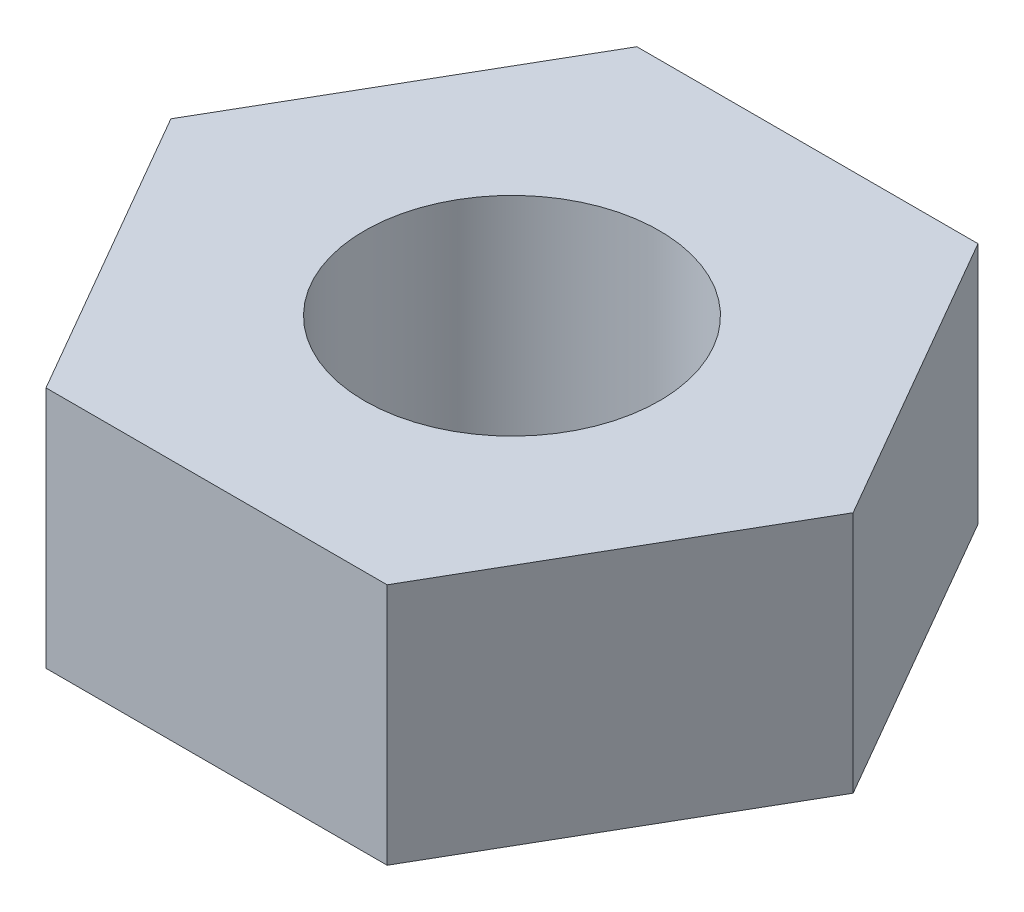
ISO-10303-21;
HEADER;
FILE_DESCRIPTION(('STEP AP214'),'2;1');
FILE_NAME('part.step','',(''),(''),'','','');
FILE_SCHEMA(('AUTOMOTIVE_DESIGN { 1 0 10303 214 1 1 1 1 }'));
ENDSEC;
DATA;
#1=APPLICATION_CONTEXT('core data for automotive mechanical design processes');
#2=APPLICATION_PROTOCOL_DEFINITION('international standard','automotive_design',2000,#1);
#3=PRODUCT_CONTEXT('',#1,'mechanical');
#4=PRODUCT('Part','Part','',(#3));
#5=PRODUCT_RELATED_PRODUCT_CATEGORY('part','',(#4));
#6=PRODUCT_DEFINITION_FORMATION('','',#4);
#7=PRODUCT_DEFINITION_CONTEXT('part definition',#1,'design');
#8=PRODUCT_DEFINITION('design','',#6,#7);
#9=PRODUCT_DEFINITION_SHAPE('','',#8);
#10=(LENGTH_UNIT() NAMED_UNIT(*) SI_UNIT(.MILLI.,.METRE.));
#11=(NAMED_UNIT(*) PLANE_ANGLE_UNIT() SI_UNIT($,.RADIAN.));
#12=(NAMED_UNIT(*) SI_UNIT($,.STERADIAN.) SOLID_ANGLE_UNIT());
#13=UNCERTAINTY_MEASURE_WITH_UNIT(LENGTH_MEASURE(1.E-05),#10,'distance_accuracy_value','');
#14=(GEOMETRIC_REPRESENTATION_CONTEXT(3) GLOBAL_UNCERTAINTY_ASSIGNED_CONTEXT((#13)) GLOBAL_UNIT_ASSIGNED_CONTEXT((#10,
#11,#12)) REPRESENTATION_CONTEXT('',''));
#15=CARTESIAN_POINT('',(0.,0.,0.));
#16=DIRECTION('',(0.,0.,1.));
#17=DIRECTION('',(1.,0.,0.));
#18=AXIS2_PLACEMENT_3D('',#15,#16,#17);
#19=CARTESIAN_POINT('',(-3.18119998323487,4.53,-5.50999999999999));
#20=DIRECTION('',(0.866025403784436,0.,-0.500000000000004));
#21=DIRECTION('',(-0.500000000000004,0.,-0.866025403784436));
#22=AXIS2_PLACEMENT_3D('',#19,#20,#21);
#23=PLANE('',#22);
#24=DIRECTION('',(0.500000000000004,0.,0.866025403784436));
#25=VECTOR('',#24,1.);
#26=CARTESIAN_POINT('',(-3.18119998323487,0.,-5.50999999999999));
#27=LINE('',#26,#25);
#28=CARTESIAN_POINT('',(-3.18119998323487,0.,-5.50999999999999));
#29=VERTEX_POINT('',#28);
#30=CARTESIAN_POINT('',(0.,0.,0.));
#31=VERTEX_POINT('',#30);
#32=EDGE_CURVE('E131',#29,#31,#27,.T.);
#33=ORIENTED_EDGE('',*,*,#32,.T.);
#34=DIRECTION('',(0.,-1.,0.));
#35=VECTOR('',#34,1.);
#36=CARTESIAN_POINT('',(0.,4.53,0.));
#37=LINE('',#36,#35);
#38=CARTESIAN_POINT('',(0.,4.53,0.));
#39=VERTEX_POINT('',#38);
#40=EDGE_CURVE('E11',#39,#31,#37,.T.);
#41=ORIENTED_EDGE('',*,*,#40,.F.);
#42=DIRECTION('',(0.500000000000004,0.,0.866025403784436));
#43=VECTOR('',#42,1.);
#44=CARTESIAN_POINT('',(-3.18119998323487,4.53,-5.50999999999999));
#45=LINE('',#44,#43);
#46=CARTESIAN_POINT('',(-3.18119998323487,4.53,-5.50999999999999));
#47=VERTEX_POINT('',#46);
#48=EDGE_CURVE('E148',#47,#39,#45,.T.);
#49=ORIENTED_EDGE('',*,*,#48,.F.);
#50=DIRECTION('',(0.,-1.,0.));
#51=VECTOR('',#50,1.);
#52=CARTESIAN_POINT('',(-3.18119998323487,4.53,-5.50999999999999));
#53=LINE('',#52,#51);
#54=EDGE_CURVE('E127',#47,#29,#53,.T.);
#55=ORIENTED_EDGE('',*,*,#54,.T.);
#56=EDGE_LOOP('',(#33,#41,#49,#55));
#57=FACE_BOUND('',#56,.T.);
#58=ADVANCED_FACE('F42',(#57),#23,.F.);
#59=CARTESIAN_POINT('',(0.,4.53,0.));
#60=DIRECTION('',(0.,0.,-1.));
#61=DIRECTION('',(-1.,0.,0.));
#62=AXIS2_PLACEMENT_3D('',#59,#60,#61);
#63=PLANE('',#62);
#64=DIRECTION('',(1.,0.,0.));
#65=VECTOR('',#64,1.);
#66=CARTESIAN_POINT('',(0.,0.,0.));
#67=LINE('',#66,#65);
#68=CARTESIAN_POINT('',(6.36239996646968,0.,0.));
#69=VERTEX_POINT('',#68);
#70=EDGE_CURVE('E135',#31,#69,#67,.T.);
#71=ORIENTED_EDGE('',*,*,#70,.T.);
#72=DIRECTION('',(0.,-1.,0.));
#73=VECTOR('',#72,1.);
#74=CARTESIAN_POINT('',(6.36239996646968,4.53,0.));
#75=LINE('',#74,#73);
#76=CARTESIAN_POINT('',(6.36239996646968,4.53,0.));
#77=VERTEX_POINT('',#76);
#78=EDGE_CURVE('E51',#77,#69,#75,.T.);
#79=ORIENTED_EDGE('',*,*,#78,.F.);
#80=DIRECTION('',(1.,0.,0.));
#81=VECTOR('',#80,1.);
#82=CARTESIAN_POINT('',(0.,4.53,0.));
#83=LINE('',#82,#81);
#84=EDGE_CURVE('E96',#39,#77,#83,.T.);
#85=ORIENTED_EDGE('',*,*,#84,.F.);
#86=ORIENTED_EDGE('',*,*,#40,.T.);
#87=EDGE_LOOP('',(#71,#79,#85,#86));
#88=FACE_BOUND('',#87,.T.);
#89=ADVANCED_FACE('F178',(#88),#63,.F.);
#90=CARTESIAN_POINT('',(6.36239996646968,4.53,0.));
#91=DIRECTION('',(-0.86602540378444,0.,-0.499999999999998));
#92=DIRECTION('',(-0.499999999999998,0.,0.86602540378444));
#93=AXIS2_PLACEMENT_3D('',#90,#91,#92);
#94=PLANE('',#93);
#95=DIRECTION('',(0.499999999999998,0.,-0.86602540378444));
#96=VECTOR('',#95,1.);
#97=CARTESIAN_POINT('',(6.36239996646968,0.,0.));
#98=LINE('',#97,#96);
#99=CARTESIAN_POINT('',(9.54359994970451,0.,-5.51000000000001));
#100=VERTEX_POINT('',#99);
#101=EDGE_CURVE('E139',#69,#100,#98,.T.);
#102=ORIENTED_EDGE('',*,*,#101,.T.);
#103=DIRECTION('',(0.,-1.,0.));
#104=VECTOR('',#103,1.);
#105=CARTESIAN_POINT('',(9.54359994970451,4.53,-5.51000000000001));
#106=LINE('',#105,#104);
#107=CARTESIAN_POINT('',(9.54359994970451,4.53,-5.51000000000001));
#108=VERTEX_POINT('',#107);
#109=EDGE_CURVE('E120',#108,#100,#106,.T.);
#110=ORIENTED_EDGE('',*,*,#109,.F.);
#111=DIRECTION('',(0.499999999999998,0.,-0.86602540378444));
#112=VECTOR('',#111,1.);
#113=CARTESIAN_POINT('',(6.36239996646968,4.53,0.));
#114=LINE('',#113,#112);
#115=EDGE_CURVE('E109',#77,#108,#114,.T.);
#116=ORIENTED_EDGE('',*,*,#115,.F.);
#117=ORIENTED_EDGE('',*,*,#78,.T.);
#118=EDGE_LOOP('',(#102,#110,#116,#117));
#119=FACE_BOUND('',#118,.T.);
#120=ADVANCED_FACE('F158',(#119),#94,.F.);
#121=CARTESIAN_POINT('',(9.54359994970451,4.53,-5.51000000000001));
#122=DIRECTION('',(-0.866025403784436,0.,0.500000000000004));
#123=DIRECTION('',(0.500000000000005,0.,0.866025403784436));
#124=AXIS2_PLACEMENT_3D('',#121,#122,#123);
#125=PLANE('',#124);
#126=DIRECTION('',(-0.500000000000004,0.,-0.866025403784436));
#127=VECTOR('',#126,1.);
#128=CARTESIAN_POINT('',(9.54359994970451,0.,-5.51000000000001));
#129=LINE('',#128,#127);
#130=CARTESIAN_POINT('',(6.36239996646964,0.,-11.02));
#131=VERTEX_POINT('',#130);
#132=EDGE_CURVE('E118',#100,#131,#129,.T.);
#133=ORIENTED_EDGE('',*,*,#132,.T.);
#134=DIRECTION('',(0.,-1.,0.));
#135=VECTOR('',#134,1.);
#136=CARTESIAN_POINT('',(6.36239996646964,4.53,-11.02));
#137=LINE('',#136,#135);
#138=CARTESIAN_POINT('',(6.36239996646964,4.53,-11.02));
#139=VERTEX_POINT('',#138);
#140=EDGE_CURVE('E115',#139,#131,#137,.T.);
#141=ORIENTED_EDGE('',*,*,#140,.F.);
#142=DIRECTION('',(-0.500000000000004,0.,-0.866025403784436));
#143=VECTOR('',#142,1.);
#144=CARTESIAN_POINT('',(9.54359994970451,4.53,-5.51000000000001));
#145=LINE('',#144,#143);
#146=EDGE_CURVE('E103',#108,#139,#145,.T.);
#147=ORIENTED_EDGE('',*,*,#146,.F.);
#148=ORIENTED_EDGE('',*,*,#109,.T.);
#149=EDGE_LOOP('',(#133,#141,#147,#148));
#150=FACE_BOUND('',#149,.T.);
#151=ADVANCED_FACE('F116',(#150),#125,.F.);
#152=CARTESIAN_POINT('',(6.36239996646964,4.53,-11.02));
#153=DIRECTION('',(0.,0.,1.));
#154=DIRECTION('',(1.,0.,0.));
#155=AXIS2_PLACEMENT_3D('',#152,#153,#154);
#156=PLANE('',#155);
#157=DIRECTION('',(-1.,0.,0.));
#158=VECTOR('',#157,1.);
#159=CARTESIAN_POINT('',(6.36239996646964,0.,-11.02));
#160=LINE('',#159,#158);
#161=CARTESIAN_POINT('',(0.,0.,-11.02));
#162=VERTEX_POINT('',#161);
#163=EDGE_CURVE('E82',#131,#162,#160,.T.);
#164=ORIENTED_EDGE('',*,*,#163,.T.);
#165=DIRECTION('',(0.,-1.,0.));
#166=VECTOR('',#165,1.);
#167=CARTESIAN_POINT('',(0.,4.53,-11.02));
#168=LINE('',#167,#166);
#169=CARTESIAN_POINT('',(0.,4.53,-11.02));
#170=VERTEX_POINT('',#169);
#171=EDGE_CURVE('E121',#170,#162,#168,.T.);
#172=ORIENTED_EDGE('',*,*,#171,.F.);
#173=DIRECTION('',(-1.,0.,0.));
#174=VECTOR('',#173,1.);
#175=CARTESIAN_POINT('',(6.36239996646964,4.53,-11.02));
#176=LINE('',#175,#174);
#177=EDGE_CURVE('E107',#139,#170,#176,.T.);
#178=ORIENTED_EDGE('',*,*,#177,.F.);
#179=ORIENTED_EDGE('',*,*,#140,.T.);
#180=EDGE_LOOP('',(#164,#172,#178,#179));
#181=FACE_BOUND('',#180,.T.);
#182=ADVANCED_FACE('F123',(#181),#156,.F.);
#183=CARTESIAN_POINT('',(0.,4.53,-11.02));
#184=DIRECTION('',(0.86602540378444,0.,0.499999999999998));
#185=DIRECTION('',(0.499999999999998,0.,-0.86602540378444));
#186=AXIS2_PLACEMENT_3D('',#183,#184,#185);
#187=PLANE('',#186);
#188=DIRECTION('',(-0.499999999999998,0.,0.86602540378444));
#189=VECTOR('',#188,1.);
#190=CARTESIAN_POINT('',(0.,0.,-11.02));
#191=LINE('',#190,#189);
#192=EDGE_CURVE('E88',#162,#29,#191,.T.);
#193=ORIENTED_EDGE('',*,*,#192,.T.);
#194=ORIENTED_EDGE('',*,*,#54,.F.);
#195=DIRECTION('',(-0.499999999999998,0.,0.86602540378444));
#196=VECTOR('',#195,1.);
#197=CARTESIAN_POINT('',(0.,4.53,-11.02));
#198=LINE('',#197,#196);
#199=EDGE_CURVE('E59',#170,#47,#198,.T.);
#200=ORIENTED_EDGE('',*,*,#199,.F.);
#201=ORIENTED_EDGE('',*,*,#171,.T.);
#202=EDGE_LOOP('',(#193,#194,#200,#201));
#203=FACE_BOUND('',#202,.T.);
#204=ADVANCED_FACE('F165',(#203),#187,.F.);
#205=CARTESIAN_POINT('',(0.,4.53,0.));
#206=DIRECTION('',(0.,1.,0.));
#207=DIRECTION('',(0.,0.,1.));
#208=AXIS2_PLACEMENT_3D('',#205,#206,#207);
#209=PLANE('',#208);
#210=CARTESIAN_POINT('',(3.18119998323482,4.53,-5.51));
#211=DIRECTION('',(0.,1.,0.));
#212=DIRECTION('',(0.,0.,1.));
#213=AXIS2_PLACEMENT_3D('',#210,#211,#212);
#214=CIRCLE('',#213,2.75);
#215=CARTESIAN_POINT('',(3.18119998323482,4.53,-2.76));
#216=VERTEX_POINT('',#215);
#217=EDGE_CURVE('E264',#216,#216,#214,.T.);
#218=ORIENTED_EDGE('',*,*,#217,.F.);
#219=EDGE_LOOP('',(#218));
#220=FACE_BOUND('',#219,.T.);
#221=ORIENTED_EDGE('',*,*,#48,.T.);
#222=ORIENTED_EDGE('',*,*,#84,.T.);
#223=ORIENTED_EDGE('',*,*,#115,.T.);
#224=ORIENTED_EDGE('',*,*,#146,.T.);
#225=ORIENTED_EDGE('',*,*,#177,.T.);
#226=ORIENTED_EDGE('',*,*,#199,.T.);
#227=EDGE_LOOP('',(#221,#222,#223,#224,#225,#226));
#228=FACE_BOUND('',#227,.T.);
#229=ADVANCED_FACE('F105',(#220,#228),#209,.T.);
#230=CARTESIAN_POINT('',(0.,0.,0.));
#231=DIRECTION('',(0.,1.,0.));
#232=DIRECTION('',(0.,0.,1.));
#233=AXIS2_PLACEMENT_3D('',#230,#231,#232);
#234=PLANE('',#233);
#235=CARTESIAN_POINT('',(3.18119998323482,0.,-5.51));
#236=DIRECTION('',(0.,1.,0.));
#237=DIRECTION('',(0.,0.,1.));
#238=AXIS2_PLACEMENT_3D('',#235,#236,#237);
#239=CIRCLE('',#238,2.75);
#240=CARTESIAN_POINT('',(3.18119998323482,0.,-2.76));
#241=VERTEX_POINT('',#240);
#242=EDGE_CURVE('E136',#241,#241,#239,.T.);
#243=ORIENTED_EDGE('',*,*,#242,.T.);
#244=EDGE_LOOP('',(#243));
#245=FACE_BOUND('',#244,.T.);
#246=ORIENTED_EDGE('',*,*,#32,.F.);
#247=ORIENTED_EDGE('',*,*,#192,.F.);
#248=ORIENTED_EDGE('',*,*,#163,.F.);
#249=ORIENTED_EDGE('',*,*,#132,.F.);
#250=ORIENTED_EDGE('',*,*,#101,.F.);
#251=ORIENTED_EDGE('',*,*,#70,.F.);
#252=EDGE_LOOP('',(#246,#247,#248,#249,#250,#251));
#253=FACE_BOUND('',#252,.T.);
#254=ADVANCED_FACE('F161',(#245,#253),#234,.F.);
#255=CARTESIAN_POINT('',(3.18119998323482,0.,-5.51));
#256=DIRECTION('',(0.,1.,0.));
#257=DIRECTION('',(0.,0.,1.));
#258=AXIS2_PLACEMENT_3D('',#255,#256,#257);
#259=CYLINDRICAL_SURFACE('',#258,2.75);
#260=ORIENTED_EDGE('',*,*,#242,.F.);
#261=EDGE_LOOP('',(#260));
#262=FACE_BOUND('',#261,.T.);
#263=ORIENTED_EDGE('',*,*,#217,.T.);
#264=EDGE_LOOP('',(#263));
#265=FACE_BOUND('',#264,.T.);
#266=ADVANCED_FACE('F213',(#262,#265),#259,.F.);
#267=CLOSED_SHELL('',(#58,#89,#120,#151,#182,#204,#229,#254,#266));
#268=MANIFOLD_SOLID_BREP('B2',#267);
#269=ADVANCED_BREP_SHAPE_REPRESENTATION('',(#18,#268),#14);
#270=SHAPE_DEFINITION_REPRESENTATION(#9,#269);
ENDSEC;
END-ISO-10303-21;
